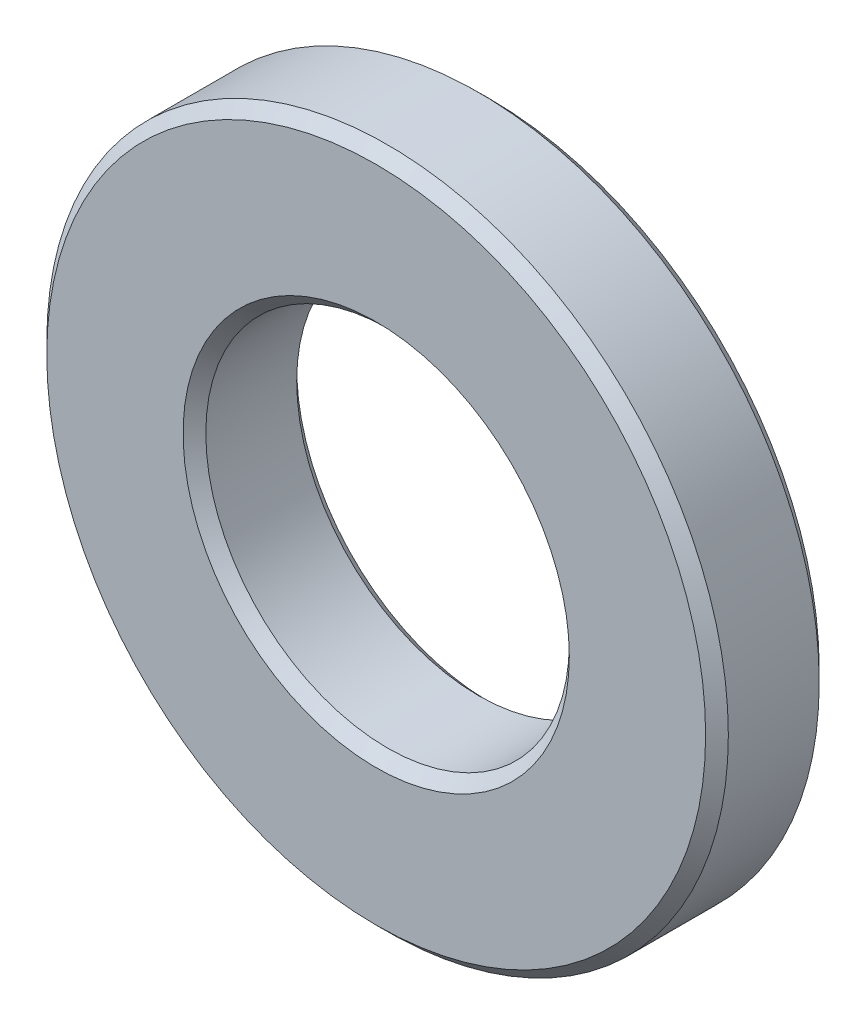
ISO-10303-21;
HEADER;
FILE_DESCRIPTION(('STEP AP214'),'2;1');
FILE_NAME('part.step','',(''),(''),'','','');
FILE_SCHEMA(('AUTOMOTIVE_DESIGN { 1 0 10303 214 1 1 1 1 }'));
ENDSEC;
DATA;
#1=APPLICATION_CONTEXT('core data for automotive mechanical design processes');
#2=APPLICATION_PROTOCOL_DEFINITION('international standard','automotive_design',2000,#1);
#3=PRODUCT_CONTEXT('',#1,'mechanical');
#4=PRODUCT('Part','Part','',(#3));
#5=PRODUCT_RELATED_PRODUCT_CATEGORY('part','',(#4));
#6=PRODUCT_DEFINITION_FORMATION('','',#4);
#7=PRODUCT_DEFINITION_CONTEXT('part definition',#1,'design');
#8=PRODUCT_DEFINITION('design','',#6,#7);
#9=PRODUCT_DEFINITION_SHAPE('','',#8);
#10=(LENGTH_UNIT() NAMED_UNIT(*) SI_UNIT(.MILLI.,.METRE.));
#11=(NAMED_UNIT(*) PLANE_ANGLE_UNIT() SI_UNIT($,.RADIAN.));
#12=(NAMED_UNIT(*) SI_UNIT($,.STERADIAN.) SOLID_ANGLE_UNIT());
#13=UNCERTAINTY_MEASURE_WITH_UNIT(LENGTH_MEASURE(1.E-05),#10,'distance_accuracy_value','');
#14=(GEOMETRIC_REPRESENTATION_CONTEXT(3) GLOBAL_UNCERTAINTY_ASSIGNED_CONTEXT((#13)) GLOBAL_UNIT_ASSIGNED_CONTEXT((#10,
#11,#12)) REPRESENTATION_CONTEXT('',''));
#15=CARTESIAN_POINT('',(0.,0.,0.));
#16=DIRECTION('',(0.,0.,1.));
#17=DIRECTION('',(1.,0.,0.));
#18=AXIS2_PLACEMENT_3D('',#15,#16,#17);
#19=CARTESIAN_POINT('',(0.,0.,0.5));
#20=DIRECTION('',(0.,0.,1.));
#21=DIRECTION('',(1.,0.,0.));
#22=AXIS2_PLACEMENT_3D('',#19,#20,#21);
#23=PLANE('',#22);
#24=CARTESIAN_POINT('',(0.,0.,0.5));
#25=DIRECTION('',(0.,0.,1.));
#26=DIRECTION('',(1.,0.,0.));
#27=AXIS2_PLACEMENT_3D('',#24,#25,#26);
#28=CIRCLE('',#27,1.7);
#29=CARTESIAN_POINT('',(1.7,0.,0.5));
#30=VERTEX_POINT('',#29);
#31=EDGE_CURVE('E10',#30,#30,#28,.F.);
#32=ORIENTED_EDGE('',*,*,#31,.T.);
#33=EDGE_LOOP('',(#32));
#34=FACE_BOUND('',#33,.T.);
#35=CARTESIAN_POINT('',(0.,0.,0.5));
#36=DIRECTION('',(0.,0.,1.));
#37=DIRECTION('',(1.,0.,0.));
#38=AXIS2_PLACEMENT_3D('',#35,#36,#37);
#39=CIRCLE('',#38,2.9);
#40=CARTESIAN_POINT('',(2.9,0.,0.5));
#41=VERTEX_POINT('',#40);
#42=EDGE_CURVE('E45',#41,#41,#39,.T.);
#43=ORIENTED_EDGE('',*,*,#42,.T.);
#44=EDGE_LOOP('',(#43));
#45=FACE_BOUND('',#44,.T.);
#46=ADVANCED_FACE('F37',(#34,#45),#23,.T.);
#47=CARTESIAN_POINT('',(0.,0.,-0.5));
#48=DIRECTION('',(0.,0.,1.));
#49=DIRECTION('',(1.,0.,0.));
#50=AXIS2_PLACEMENT_3D('',#47,#48,#49);
#51=PLANE('',#50);
#52=CARTESIAN_POINT('',(0.,0.,-0.5));
#53=DIRECTION('',(0.,0.,1.));
#54=DIRECTION('',(1.,0.,0.));
#55=AXIS2_PLACEMENT_3D('',#52,#53,#54);
#56=CIRCLE('',#55,2.9);
#57=CARTESIAN_POINT('',(2.9,0.,-0.5));
#58=VERTEX_POINT('',#57);
#59=EDGE_CURVE('E63',#58,#58,#56,.F.);
#60=ORIENTED_EDGE('',*,*,#59,.T.);
#61=EDGE_LOOP('',(#60));
#62=FACE_BOUND('',#61,.T.);
#63=CARTESIAN_POINT('',(0.,0.,-0.5));
#64=DIRECTION('',(0.,0.,1.));
#65=DIRECTION('',(1.,0.,0.));
#66=AXIS2_PLACEMENT_3D('',#63,#64,#65);
#67=CIRCLE('',#66,1.7);
#68=CARTESIAN_POINT('',(1.7,0.,-0.5));
#69=VERTEX_POINT('',#68);
#70=EDGE_CURVE('E67',#69,#69,#67,.T.);
#71=ORIENTED_EDGE('',*,*,#70,.T.);
#72=EDGE_LOOP('',(#71));
#73=FACE_BOUND('',#72,.T.);
#74=ADVANCED_FACE('F89',(#62,#73),#51,.F.);
#75=CARTESIAN_POINT('',(0.,0.,0.5));
#76=DIRECTION('',(0.,0.,-1.));
#77=DIRECTION('',(-1.,0.,0.));
#78=AXIS2_PLACEMENT_3D('',#75,#76,#77);
#79=CYLINDRICAL_SURFACE('',#78,3.);
#80=CARTESIAN_POINT('',(0.,0.,-0.4));
#81=DIRECTION('',(0.,0.,1.));
#82=DIRECTION('',(1.,0.,0.));
#83=AXIS2_PLACEMENT_3D('',#80,#81,#82);
#84=CIRCLE('',#83,3.);
#85=CARTESIAN_POINT('',(3.,0.,-0.4));
#86=VERTEX_POINT('',#85);
#87=EDGE_CURVE('E70',#86,#86,#84,.T.);
#88=ORIENTED_EDGE('',*,*,#87,.T.);
#89=EDGE_LOOP('',(#88));
#90=FACE_BOUND('',#89,.T.);
#91=CARTESIAN_POINT('',(0.,0.,0.399999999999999));
#92=DIRECTION('',(0.,0.,1.));
#93=DIRECTION('',(1.,0.,0.));
#94=AXIS2_PLACEMENT_3D('',#91,#92,#93);
#95=CIRCLE('',#94,3.);
#96=CARTESIAN_POINT('',(3.,0.,0.399999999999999));
#97=VERTEX_POINT('',#96);
#98=EDGE_CURVE('E73',#97,#97,#95,.F.);
#99=ORIENTED_EDGE('',*,*,#98,.T.);
#100=EDGE_LOOP('',(#99));
#101=FACE_BOUND('',#100,.T.);
#102=ADVANCED_FACE('F78',(#90,#101),#79,.T.);
#103=CARTESIAN_POINT('',(0.,0.,0.5));
#104=DIRECTION('',(0.,0.,-1.));
#105=DIRECTION('',(-1.,0.,0.));
#106=AXIS2_PLACEMENT_3D('',#103,#104,#105);
#107=CYLINDRICAL_SURFACE('',#106,1.6);
#108=CARTESIAN_POINT('',(0.,0.,-0.400000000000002));
#109=DIRECTION('',(0.,0.,1.));
#110=DIRECTION('',(1.,0.,0.));
#111=AXIS2_PLACEMENT_3D('',#108,#109,#110);
#112=CIRCLE('',#111,1.6);
#113=CARTESIAN_POINT('',(1.6,0.,-0.400000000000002));
#114=VERTEX_POINT('',#113);
#115=EDGE_CURVE('E52',#114,#114,#112,.F.);
#116=ORIENTED_EDGE('',*,*,#115,.T.);
#117=EDGE_LOOP('',(#116));
#118=FACE_BOUND('',#117,.T.);
#119=CARTESIAN_POINT('',(0.,0.,0.4));
#120=DIRECTION('',(0.,0.,1.));
#121=DIRECTION('',(1.,0.,0.));
#122=AXIS2_PLACEMENT_3D('',#119,#120,#121);
#123=CIRCLE('',#122,1.6);
#124=CARTESIAN_POINT('',(1.6,0.,0.4));
#125=VERTEX_POINT('',#124);
#126=EDGE_CURVE('E57',#125,#125,#123,.T.);
#127=ORIENTED_EDGE('',*,*,#126,.T.);
#128=EDGE_LOOP('',(#127));
#129=FACE_BOUND('',#128,.T.);
#130=ADVANCED_FACE('F97',(#118,#129),#107,.F.);
#131=CARTESIAN_POINT('',(0.,0.,-0.4));
#132=DIRECTION('',(0.,0.,1.));
#133=DIRECTION('',(1.,0.,0.));
#134=AXIS2_PLACEMENT_3D('',#131,#132,#133);
#135=CONICAL_SURFACE('',#134,3.,0.78539816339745);
#136=ORIENTED_EDGE('',*,*,#59,.F.);
#137=EDGE_LOOP('',(#136));
#138=FACE_BOUND('',#137,.T.);
#139=ORIENTED_EDGE('',*,*,#87,.F.);
#140=EDGE_LOOP('',(#139));
#141=FACE_BOUND('',#140,.T.);
#142=ADVANCED_FACE('F102',(#138,#141),#135,.T.);
#143=CARTESIAN_POINT('',(0.,0.,-0.5));
#144=DIRECTION('',(0.,0.,-1.));
#145=DIRECTION('',(-1.,0.,0.));
#146=AXIS2_PLACEMENT_3D('',#143,#144,#145);
#147=CONICAL_SURFACE('',#146,1.7,0.785398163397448);
#148=ORIENTED_EDGE('',*,*,#115,.F.);
#149=EDGE_LOOP('',(#148));
#150=FACE_BOUND('',#149,.T.);
#151=ORIENTED_EDGE('',*,*,#70,.F.);
#152=EDGE_LOOP('',(#151));
#153=FACE_BOUND('',#152,.T.);
#154=ADVANCED_FACE('F86',(#150,#153),#147,.F.);
#155=CARTESIAN_POINT('',(0.,0.,0.4));
#156=DIRECTION('',(0.,0.,1.));
#157=DIRECTION('',(1.,0.,0.));
#158=AXIS2_PLACEMENT_3D('',#155,#156,#157);
#159=CONICAL_SURFACE('',#158,1.6,0.785398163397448);
#160=CARTESIAN_POINT('',(1.7,0.,0.5));
#161=CARTESIAN_POINT('',(1.69895833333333,0.,0.498958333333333));
#162=CARTESIAN_POINT('',(1.69791666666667,0.,0.497916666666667));
#163=CARTESIAN_POINT('',(1.69583333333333,0.,0.495833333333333));
#164=CARTESIAN_POINT('',(1.69479166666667,0.,0.494791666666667));
#165=CARTESIAN_POINT('',(1.69270833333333,0.,0.492708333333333));
#166=CARTESIAN_POINT('',(1.69166666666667,0.,0.491666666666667));
#167=CARTESIAN_POINT('',(1.68958333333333,0.,0.489583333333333));
#168=CARTESIAN_POINT('',(1.68854166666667,0.,0.488541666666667));
#169=CARTESIAN_POINT('',(1.68645833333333,0.,0.486458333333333));
#170=CARTESIAN_POINT('',(1.68541666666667,0.,0.485416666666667));
#171=CARTESIAN_POINT('',(1.68333333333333,0.,0.483333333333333));
#172=CARTESIAN_POINT('',(1.68229166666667,0.,0.482291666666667));
#173=CARTESIAN_POINT('',(1.68020833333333,0.,0.480208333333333));
#174=CARTESIAN_POINT('',(1.67916666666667,0.,0.479166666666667));
#175=CARTESIAN_POINT('',(1.67708333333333,0.,0.477083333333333));
#176=CARTESIAN_POINT('',(1.67604166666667,0.,0.476041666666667));
#177=CARTESIAN_POINT('',(1.67395833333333,0.,0.473958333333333));
#178=CARTESIAN_POINT('',(1.67291666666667,0.,0.472916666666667));
#179=CARTESIAN_POINT('',(1.67083333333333,0.,0.470833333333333));
#180=CARTESIAN_POINT('',(1.66979166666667,0.,0.469791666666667));
#181=CARTESIAN_POINT('',(1.66770833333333,0.,0.467708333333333));
#182=CARTESIAN_POINT('',(1.66666666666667,0.,0.466666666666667));
#183=CARTESIAN_POINT('',(1.66458333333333,0.,0.464583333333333));
#184=CARTESIAN_POINT('',(1.66354166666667,0.,0.463541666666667));
#185=CARTESIAN_POINT('',(1.66145833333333,0.,0.461458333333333));
#186=CARTESIAN_POINT('',(1.66041666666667,0.,0.460416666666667));
#187=CARTESIAN_POINT('',(1.65833333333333,0.,0.458333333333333));
#188=CARTESIAN_POINT('',(1.65729166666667,0.,0.457291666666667));
#189=CARTESIAN_POINT('',(1.65520833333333,0.,0.455208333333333));
#190=CARTESIAN_POINT('',(1.65416666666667,0.,0.454166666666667));
#191=CARTESIAN_POINT('',(1.65208333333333,0.,0.452083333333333));
#192=CARTESIAN_POINT('',(1.65104166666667,0.,0.451041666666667));
#193=CARTESIAN_POINT('',(1.64895833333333,0.,0.448958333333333));
#194=CARTESIAN_POINT('',(1.64791666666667,0.,0.447916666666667));
#195=CARTESIAN_POINT('',(1.64583333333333,0.,0.445833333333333));
#196=CARTESIAN_POINT('',(1.64479166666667,0.,0.444791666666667));
#197=CARTESIAN_POINT('',(1.64270833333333,0.,0.442708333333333));
#198=CARTESIAN_POINT('',(1.64166666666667,0.,0.441666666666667));
#199=CARTESIAN_POINT('',(1.63958333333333,0.,0.439583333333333));
#200=CARTESIAN_POINT('',(1.63854166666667,0.,0.438541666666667));
#201=CARTESIAN_POINT('',(1.63645833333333,0.,0.436458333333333));
#202=CARTESIAN_POINT('',(1.63541666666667,0.,0.435416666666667));
#203=CARTESIAN_POINT('',(1.63333333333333,0.,0.433333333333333));
#204=CARTESIAN_POINT('',(1.63229166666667,0.,0.432291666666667));
#205=CARTESIAN_POINT('',(1.63020833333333,0.,0.430208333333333));
#206=CARTESIAN_POINT('',(1.62916666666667,0.,0.429166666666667));
#207=CARTESIAN_POINT('',(1.62708333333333,0.,0.427083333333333));
#208=CARTESIAN_POINT('',(1.62604166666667,0.,0.426041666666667));
#209=CARTESIAN_POINT('',(1.62395833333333,0.,0.423958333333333));
#210=CARTESIAN_POINT('',(1.62291666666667,0.,0.422916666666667));
#211=CARTESIAN_POINT('',(1.62083333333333,0.,0.420833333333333));
#212=CARTESIAN_POINT('',(1.61979166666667,0.,0.419791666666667));
#213=CARTESIAN_POINT('',(1.61770833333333,0.,0.417708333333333));
#214=CARTESIAN_POINT('',(1.61666666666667,0.,0.416666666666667));
#215=CARTESIAN_POINT('',(1.61458333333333,0.,0.414583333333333));
#216=CARTESIAN_POINT('',(1.61354166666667,0.,0.413541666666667));
#217=CARTESIAN_POINT('',(1.61145833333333,0.,0.411458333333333));
#218=CARTESIAN_POINT('',(1.61041666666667,0.,0.410416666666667));
#219=CARTESIAN_POINT('',(1.60833333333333,0.,0.408333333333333));
#220=CARTESIAN_POINT('',(1.60729166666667,0.,0.407291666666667));
#221=CARTESIAN_POINT('',(1.60520833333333,0.,0.405208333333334));
#222=CARTESIAN_POINT('',(1.60416666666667,0.,0.404166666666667));
#223=CARTESIAN_POINT('',(1.60208333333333,0.,0.402083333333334));
#224=CARTESIAN_POINT('',(1.60104166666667,0.,0.401041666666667));
#225=CARTESIAN_POINT('',(1.6,0.,0.4));
#226=B_SPLINE_CURVE_WITH_KNOTS('',3,(#160,#161,#162,#163,#164,#165,#166,#167,#168,#169,#170,
#171,#172,#173,#174,#175,#176,#177,#178,#179,#180,#181,#182,#183,#184,#185,#186,#187,#188,#189,
#190,#191,#192,#193,#194,#195,#196,#197,#198,#199,#200,#201,#202,#203,#204,#205,#206,#207,#208,
#209,#210,#211,#212,#213,#214,#215,#216,#217,#218,#219,#220,#221,#222,#223,#224,#225),
.UNSPECIFIED.,.F.,.F.,(4,2,2,2,2,2,2,2,2,2,2,2,2,2,2,2,2,2,2,2,2,2,2,2,2,2,2,2,2,2,2,2,4),(0.,
0.00441941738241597,0.00883883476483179,0.0132582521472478,0.0176776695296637,
0.0220970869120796,0.0265165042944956,0.0309359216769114,0.0353553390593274,0.0397747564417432,
0.0441941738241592,0.048613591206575,0.053033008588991,0.0574524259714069,0.0618718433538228,
0.0662912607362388,0.0707106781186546,0.0751300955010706,0.0795495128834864,0.0839689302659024,
0.0883883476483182,0.0928077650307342,0.0972271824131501,0.101646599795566,0.106066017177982,
0.110485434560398,0.114904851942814,0.11932426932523,0.123743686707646,0.128163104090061,
0.132582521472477,0.137001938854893,0.141421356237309),.UNSPECIFIED.);
#227=EDGE_CURVE('BSEAM82',#30,#125,#226,.T.);
#228=ORIENTED_EDGE('',*,*,#31,.F.);
#229=ORIENTED_EDGE('',*,*,#126,.F.);
#230=ORIENTED_EDGE('',*,*,#227,.T.);
#231=ORIENTED_EDGE('',*,*,#227,.F.);
#232=EDGE_LOOP('',(#228,#230,#229,#231));
#233=FACE_BOUND('',#232,.T.);
#234=ADVANCED_FACE('F82',(#233),#159,.F.);
#235=CARTESIAN_POINT('',(0.,0.,0.5));
#236=DIRECTION('',(0.,0.,-1.));
#237=DIRECTION('',(-1.,0.,0.));
#238=AXIS2_PLACEMENT_3D('',#235,#236,#237);
#239=CONICAL_SURFACE('',#238,2.9,0.785398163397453);
#240=ORIENTED_EDGE('',*,*,#98,.F.);
#241=EDGE_LOOP('',(#240));
#242=FACE_BOUND('',#241,.T.);
#243=ORIENTED_EDGE('',*,*,#42,.F.);
#244=EDGE_LOOP('',(#243));
#245=FACE_BOUND('',#244,.T.);
#246=ADVANCED_FACE('F39',(#242,#245),#239,.T.);
#247=CLOSED_SHELL('',(#46,#74,#102,#130,#142,#154,#234,#246));
#248=MANIFOLD_SOLID_BREP('B2',#247);
#249=ADVANCED_BREP_SHAPE_REPRESENTATION('',(#18,#248),#14);
#250=SHAPE_DEFINITION_REPRESENTATION(#9,#249);
ENDSEC;
END-ISO-10303-21;
